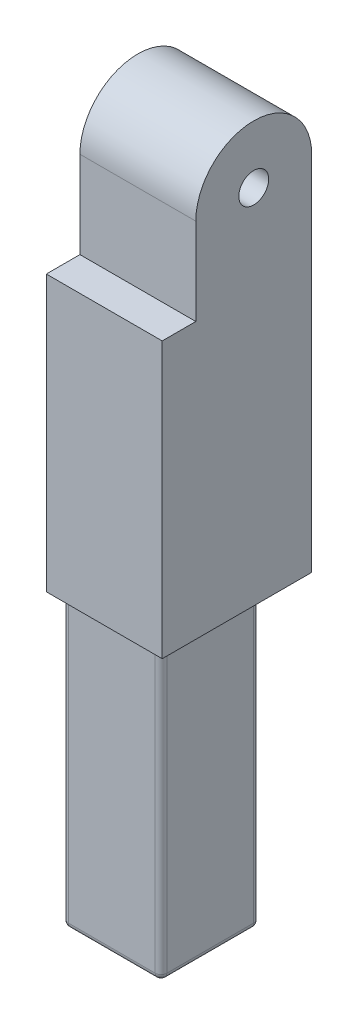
from build123d import *

# Parameters (mm, degrees)
SKETCH1_R          = 6.54812
EXTRUDE1_DEPTH     = 101.6
SKETCH2_W          = 127.290282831
SKETCH2_H          = 91.70538421
SKETCH2_W_2        = 43.18
SKETCH2_H_2        = 43.18
CUT_EXTRUDE1_DEPTH = 50.8
CUT_EXTRUDE2_DEPTH = 191.076195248
CHAMFER1_SIZE      = 1.5875
SKETCH7_W          = 81.362491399
SKETCH7_H          = 25.51177979
CUT_EXTRUDE6_DEPTH = 163.639355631
SKETCH8_W          = 127
SKETCH8_H          = 50.8
EXTRUDE2_DEPTH     = 50.8
SKETCH9_W          = 111.384759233
SKETCH9_H          = 85.616643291
SKETCH9_W_2        = 43.18
SKETCH9_H_2        = 43.18
CUT_EXTRUDE7_DEPTH = 50.8
SKETCH10_W         = 65.544359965
SKETCH10_H         = 72.013522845
CUT_EXTRUDE8_DEPTH = 162.144934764
CHAMFER2_SIZE      = 1.5875
SKETCH11_W         = 63.367101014
SKETCH11_H         = 58.733984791
CUT_EXTRUDE9_DEPTH = 128.633420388
SKETCH12_W         = 50.8
SKETCH12_H         = 50.8
EXTRUDE3_DEPTH     = 19.05
SKETCH13_W         = 50.8
SKETCH13_H         = 69.85
EXTRUDE4_DEPTH     = 14.732
SKETCH14_W         = 50.8
SKETCH14_H         = 65.532
EXTRUDE5_DEPTH     = 50.8
SKETCH15_W         = 43.18
SKETCH15_H         = 43.18
EXTRUDE6_DEPTH     = 127
FILLET1_R          = 2.54


with BuildPart() as part:
    # Sketch1 → Extrude1 (new body)
    with BuildSketch(Plane(origin=(0, 0, 0), x_dir=(0, 0, -1), z_dir=(1, 0, 0))):
        with BuildLine():
            Line((25.4, 0), (25.4, -152.4))
            Line((25.4, -152.4), (-25.4, -152.4))
            Line((-25.4, -152.4), (-25.4, 0))
            ThreePointArc((-25.4, 0), (0, 25.4), (25.4, 0))
        make_face()
        Circle(SKETCH1_R, mode=Mode.SUBTRACT)
    extrude(amount=EXTRUDE1_DEPTH)

    # Sketch2 → Cut-Extrude1 (cut)
    with BuildSketch(Plane.XZ.offset(152.4)):
        with Locations((47.054436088, 2.762017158)):
            Rectangle(SKETCH2_W, SKETCH2_H)
        with Locations((25.4, 0)):
            Rectangle(SKETCH2_W_2, SKETCH2_H_2, mode=Mode.SUBTRACT)
    extrude(amount=-CUT_EXTRUDE1_DEPTH, mode=Mode.SUBTRACT)

    # Sketch3 → Cut-Extrude2 (cut, through all)
    with BuildSketch(Plane.XY.offset(25.4)):
        Polygon((72.086299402, 35.691683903), (107.903381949, 35.691683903), (107.903381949, -88.9), (55.515881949, -88.9), (50.8, -88.9), (50.8, 35.691683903), align=None)
    extrude(amount=-CUT_EXTRUDE2_DEPTH, mode=Mode.SUBTRACT)

    # Chamfer1
    chamfer1_edges = [part.edges().sort_by_distance(p)[0] for p in [
        (3.81, -152.4, 0),
        (25.4, -152.4, 21.59),
        (46.99, -152.4, 0),
        (25.4, -152.4, -21.59),
    ]]
    chamfer(chamfer1_edges, length=CHAMFER1_SIZE)

    # Sketch7 → Cut-Extrude6 (cut, through all)
    with BuildSketch(Plane(origin=(50.8, 0, 0), x_dir=(0, 0, -1), z_dir=(1, 0, 0))):
        with Locations((-0.092181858, -91.747412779)):
            Rectangle(SKETCH7_W, SKETCH7_H)
    extrude(amount=CUT_EXTRUDE6_DEPTH, mode=Mode.SUBTRACT)

    # Sketch8 → Extrude2 (add)
    with BuildSketch(Plane(origin=(50.8, 0, 0), x_dir=(0, 0, -1), z_dir=(1, 0, 0))):
        with Locations((-38.1, -63.5)):
            Rectangle(SKETCH8_W, SKETCH8_H)
    extrude(amount=-EXTRUDE2_DEPTH)

    # Sketch9 → Cut-Extrude7 (cut)
    with BuildSketch(Plane.XY.offset(101.6)):
        with Locations((28.932725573, -66.547841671)):
            Rectangle(SKETCH9_W, SKETCH9_H)
        with Locations((25.4, -63.5)):
            Rectangle(SKETCH9_W_2, SKETCH9_H_2, mode=Mode.SUBTRACT)
    extrude(amount=-CUT_EXTRUDE7_DEPTH, mode=Mode.SUBTRACT)

    # Sketch10 → Cut-Extrude8 (cut, through all)
    with BuildSketch(Plane.XZ.offset(88.9)):
        with Locations((24.931303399, -6.269616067)):
            Rectangle(SKETCH10_W, SKETCH10_H)
    extrude(amount=CUT_EXTRUDE8_DEPTH, mode=Mode.SUBTRACT)

    # Chamfer2
    chamfer2_edges = [part.edges().sort_by_distance(p)[0] for p in [
        (3.81, -63.5, 101.6),
        (25.4, -41.91, 101.6),
        (46.99, -63.5, 101.6),
        (25.4, -85.09, 101.6),
    ]]
    chamfer(chamfer2_edges, length=CHAMFER2_SIZE)

    # Sketch11 → Cut-Extrude9 (cut, through all)
    with BuildSketch(Plane.XY.offset(25.4)):
        with Locations((26.162276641, -62.049982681)):
            Rectangle(SKETCH11_W, SKETCH11_H)
    extrude(amount=CUT_EXTRUDE9_DEPTH, mode=Mode.SUBTRACT)

    # Sketch12 → Extrude3 (add)
    with BuildSketch(Plane.XZ.offset(88.9)):
        with Locations((25.4, 0)):
            Rectangle(SKETCH12_W, SKETCH12_H)
    extrude(amount=EXTRUDE3_DEPTH)

    # Sketch13 → Extrude4 (add)
    with BuildSketch(Plane.XY.offset(25.4)):
        with Locations((25.4, -73.025)):
            Rectangle(SKETCH13_W, SKETCH13_H)
    extrude(amount=EXTRUDE4_DEPTH)

    # Sketch14 → Extrude5 (add)
    with BuildSketch(Plane.XZ.offset(107.95)):
        with Locations((25.4, 7.366)):
            Rectangle(SKETCH14_W, SKETCH14_H)
    extrude(amount=EXTRUDE5_DEPTH)

    # Sketch15 → Extrude6 (add)
    with BuildSketch(Plane.XZ.offset(158.75)):
        with Locations((25.146, 14.986)):
            Rectangle(SKETCH15_W, SKETCH15_H)
    extrude(amount=EXTRUDE6_DEPTH)

    # Fillet1
    fillet1_edges = [part.edges().sort_by_distance(p)[0] for p in [
        (3.556, -222.25, 36.576),
        (3.556, -222.25, -6.604),
        (46.736, -222.25, -6.604),
        (46.736, -222.25, 36.576),
        (3.556, -285.75, 14.986),
        (25.146, -285.75, -6.604),
        (46.736, -285.75, 14.986),
        (25.146, -285.75, 36.576),
    ]]
    fillet(fillet1_edges, radius=FILLET1_R)


solid = part.part
